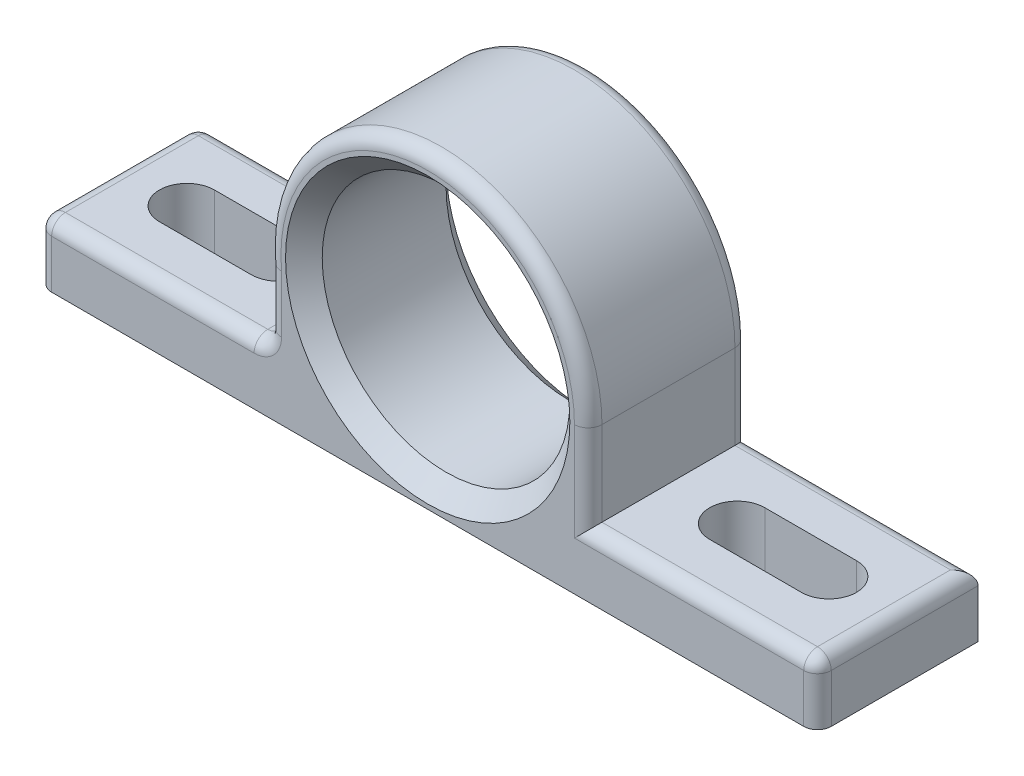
ISO-10303-21;
HEADER;
FILE_DESCRIPTION(('STEP AP214'),'2;1');
FILE_NAME('part.step','',(''),(''),'','','');
FILE_SCHEMA(('AUTOMOTIVE_DESIGN { 1 0 10303 214 1 1 1 1 }'));
ENDSEC;
DATA;
#1=APPLICATION_CONTEXT('core data for automotive mechanical design processes');
#2=APPLICATION_PROTOCOL_DEFINITION('international standard','automotive_design',2000,#1);
#3=PRODUCT_CONTEXT('',#1,'mechanical');
#4=PRODUCT('Part','Part','',(#3));
#5=PRODUCT_RELATED_PRODUCT_CATEGORY('part','',(#4));
#6=PRODUCT_DEFINITION_FORMATION('','',#4);
#7=PRODUCT_DEFINITION_CONTEXT('part definition',#1,'design');
#8=PRODUCT_DEFINITION('design','',#6,#7);
#9=PRODUCT_DEFINITION_SHAPE('','',#8);
#10=(LENGTH_UNIT() NAMED_UNIT(*) SI_UNIT(.MILLI.,.METRE.));
#11=(NAMED_UNIT(*) PLANE_ANGLE_UNIT() SI_UNIT($,.RADIAN.));
#12=(NAMED_UNIT(*) SI_UNIT($,.STERADIAN.) SOLID_ANGLE_UNIT());
#13=UNCERTAINTY_MEASURE_WITH_UNIT(LENGTH_MEASURE(1.E-05),#10,'distance_accuracy_value','');
#14=(GEOMETRIC_REPRESENTATION_CONTEXT(3) GLOBAL_UNCERTAINTY_ASSIGNED_CONTEXT((#13)) GLOBAL_UNIT_ASSIGNED_CONTEXT((#10,
#11,#12)) REPRESENTATION_CONTEXT('',''));
#15=CARTESIAN_POINT('',(0.,0.,0.));
#16=DIRECTION('',(0.,0.,1.));
#17=DIRECTION('',(1.,0.,0.));
#18=AXIS2_PLACEMENT_3D('',#15,#16,#17);
#19=CARTESIAN_POINT('',(0.,0.,17.5));
#20=DIRECTION('',(0.,0.,1.));
#21=DIRECTION('',(1.,0.,0.));
#22=AXIS2_PLACEMENT_3D('',#19,#20,#21);
#23=PLANE('',#22);
#24=CARTESIAN_POINT('',(0.,0.,17.5));
#25=DIRECTION('',(0.,0.,1.));
#26=DIRECTION('',(1.,0.,0.));
#27=AXIS2_PLACEMENT_3D('',#24,#25,#26);
#28=CIRCLE('',#27,31.);
#29=CARTESIAN_POINT('',(31.,0.,17.5));
#30=VERTEX_POINT('',#29);
#31=EDGE_CURVE('E11',#30,#30,#28,.F.);
#32=ORIENTED_EDGE('',*,*,#31,.T.);
#33=EDGE_LOOP('',(#32));
#34=FACE_BOUND('',#33,.T.);
#35=DIRECTION('',(1.,0.,0.));
#36=VECTOR('',#35,1.);
#37=CARTESIAN_POINT('',(85.,-32.,17.5));
#38=LINE('',#37,#36);
#39=CARTESIAN_POINT('',(-82.,-32.,17.5));
#40=VERTEX_POINT('',#39);
#41=CARTESIAN_POINT('',(82.,-32.,17.5));
#42=VERTEX_POINT('',#41);
#43=EDGE_CURVE('E282',#40,#42,#38,.T.);
#44=ORIENTED_EDGE('',*,*,#43,.T.);
#45=DIRECTION('',(0.,1.,0.));
#46=VECTOR('',#45,1.);
#47=CARTESIAN_POINT('',(82.,-18.4340909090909,17.5));
#48=LINE('',#47,#46);
#49=CARTESIAN_POINT('',(82.,-21.4340909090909,17.5));
#50=VERTEX_POINT('',#49);
#51=EDGE_CURVE('E360',#42,#50,#48,.T.);
#52=ORIENTED_EDGE('',*,*,#51,.T.);
#53=DIRECTION('',(-1.,0.,0.));
#54=VECTOR('',#53,1.);
#55=CARTESIAN_POINT('',(35.,-21.4340909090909,17.5));
#56=LINE('',#55,#54);
#57=CARTESIAN_POINT('',(32.,-21.4340909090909,17.5));
#58=VERTEX_POINT('',#57);
#59=EDGE_CURVE('E358',#50,#58,#56,.T.);
#60=ORIENTED_EDGE('',*,*,#59,.T.);
#61=DIRECTION('',(0.,1.,0.));
#62=VECTOR('',#61,1.);
#63=CARTESIAN_POINT('',(32.,0.,17.5));
#64=LINE('',#63,#62);
#65=CARTESIAN_POINT('',(32.,0.,17.5));
#66=VERTEX_POINT('',#65);
#67=EDGE_CURVE('E356',#58,#66,#64,.T.);
#68=ORIENTED_EDGE('',*,*,#67,.T.);
#69=CARTESIAN_POINT('',(0.,0.,17.5));
#70=DIRECTION('',(0.,0.,1.));
#71=DIRECTION('',(1.,0.,0.));
#72=AXIS2_PLACEMENT_3D('',#69,#70,#71);
#73=CIRCLE('',#72,32.);
#74=CARTESIAN_POINT('',(-31.8645447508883,-2.94122216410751,17.5));
#75=VERTEX_POINT('',#74);
#76=EDGE_CURVE('E354',#66,#75,#73,.T.);
#77=ORIENTED_EDGE('',*,*,#76,.T.);
#78=DIRECTION('',(0.,-1.,0.));
#79=VECTOR('',#78,1.);
#80=CARTESIAN_POINT('',(-31.8645447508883,-18.4340909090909,17.5));
#81=LINE('',#80,#79);
#82=CARTESIAN_POINT('',(-31.8645447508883,-15.4340909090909,17.5));
#83=VERTEX_POINT('',#82);
#84=EDGE_CURVE('E352',#75,#83,#81,.T.);
#85=ORIENTED_EDGE('',*,*,#84,.T.);
#86=CARTESIAN_POINT('',(-37.8645447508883,-15.4340909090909,17.5));
#87=DIRECTION('',(0.,0.,1.));
#88=DIRECTION('',(1.,0.,0.));
#89=AXIS2_PLACEMENT_3D('',#86,#87,#88);
#90=CIRCLE('',#89,6.);
#91=CARTESIAN_POINT('',(-37.8645447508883,-21.4340909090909,17.5));
#92=VERTEX_POINT('',#91);
#93=EDGE_CURVE('E349',#92,#83,#90,.T.);
#94=ORIENTED_EDGE('',*,*,#93,.F.);
#95=DIRECTION('',(-1.,0.,0.));
#96=VECTOR('',#95,1.);
#97=CARTESIAN_POINT('',(-85.,-21.4340909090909,17.5));
#98=LINE('',#97,#96);
#99=CARTESIAN_POINT('',(-82.,-21.4340909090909,17.5));
#100=VERTEX_POINT('',#99);
#101=EDGE_CURVE('E345',#92,#100,#98,.T.);
#102=ORIENTED_EDGE('',*,*,#101,.T.);
#103=DIRECTION('',(0.,-1.,0.));
#104=VECTOR('',#103,1.);
#105=CARTESIAN_POINT('',(-82.,-32.,17.5));
#106=LINE('',#105,#104);
#107=EDGE_CURVE('E347',#100,#40,#106,.T.);
#108=ORIENTED_EDGE('',*,*,#107,.T.);
#109=EDGE_LOOP('',(#44,#52,#60,#68,#77,#85,#94,#102,#108));
#110=FACE_BOUND('',#109,.T.);
#111=ADVANCED_FACE('F28',(#34,#110),#23,.T.);
#112=CARTESIAN_POINT('',(0.,0.,-17.5));
#113=DIRECTION('',(0.,0.,1.));
#114=DIRECTION('',(1.,0.,0.));
#115=AXIS2_PLACEMENT_3D('',#112,#113,#114);
#116=PLANE('',#115);
#117=CARTESIAN_POINT('',(0.,0.,-17.5));
#118=DIRECTION('',(0.,0.,1.));
#119=DIRECTION('',(1.,0.,0.));
#120=AXIS2_PLACEMENT_3D('',#117,#118,#119);
#121=CIRCLE('',#120,31.);
#122=CARTESIAN_POINT('',(31.,0.,-17.5));
#123=VERTEX_POINT('',#122);
#124=EDGE_CURVE('E385',#123,#123,#121,.T.);
#125=ORIENTED_EDGE('',*,*,#124,.T.);
#126=EDGE_LOOP('',(#125));
#127=FACE_BOUND('',#126,.T.);
#128=DIRECTION('',(0.,1.,0.));
#129=VECTOR('',#128,1.);
#130=CARTESIAN_POINT('',(32.,0.,-17.5));
#131=LINE('',#130,#129);
#132=CARTESIAN_POINT('',(32.,0.,-17.5));
#133=VERTEX_POINT('',#132);
#134=CARTESIAN_POINT('',(32.,-21.4340909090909,-17.5));
#135=VERTEX_POINT('',#134);
#136=EDGE_CURVE('E324',#133,#135,#131,.F.);
#137=ORIENTED_EDGE('',*,*,#136,.T.);
#138=DIRECTION('',(-1.,0.,0.));
#139=VECTOR('',#138,1.);
#140=CARTESIAN_POINT('',(0.,-21.4340909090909,-17.5));
#141=LINE('',#140,#139);
#142=CARTESIAN_POINT('',(85.,-21.4340909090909,-17.5));
#143=VERTEX_POINT('',#142);
#144=EDGE_CURVE('E327',#135,#143,#141,.F.);
#145=ORIENTED_EDGE('',*,*,#144,.T.);
#146=DIRECTION('',(0.,1.,0.));
#147=VECTOR('',#146,1.);
#148=CARTESIAN_POINT('',(85.,-18.4340909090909,-17.5));
#149=LINE('',#148,#147);
#150=CARTESIAN_POINT('',(85.,-32.,-17.5));
#151=VERTEX_POINT('',#150);
#152=EDGE_CURVE('E279',#151,#143,#149,.T.);
#153=ORIENTED_EDGE('',*,*,#152,.F.);
#154=DIRECTION('',(1.,0.,0.));
#155=VECTOR('',#154,1.);
#156=CARTESIAN_POINT('',(85.,-32.,-17.5));
#157=LINE('',#156,#155);
#158=CARTESIAN_POINT('',(-82.,-32.,-17.5));
#159=VERTEX_POINT('',#158);
#160=EDGE_CURVE('E276',#159,#151,#157,.T.);
#161=ORIENTED_EDGE('',*,*,#160,.F.);
#162=DIRECTION('',(0.,-1.,0.));
#163=VECTOR('',#162,1.);
#164=CARTESIAN_POINT('',(-82.,0.,-17.5));
#165=LINE('',#164,#163);
#166=CARTESIAN_POINT('',(-82.,-21.4340909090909,-17.5));
#167=VERTEX_POINT('',#166);
#168=EDGE_CURVE('E318',#159,#167,#165,.F.);
#169=ORIENTED_EDGE('',*,*,#168,.T.);
#170=DIRECTION('',(-1.,0.,0.));
#171=VECTOR('',#170,1.);
#172=CARTESIAN_POINT('',(0.,-21.4340909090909,-17.5));
#173=LINE('',#172,#171);
#174=CARTESIAN_POINT('',(-37.8645447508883,-21.4340909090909,-17.5));
#175=VERTEX_POINT('',#174);
#176=EDGE_CURVE('E316',#167,#175,#173,.F.);
#177=ORIENTED_EDGE('',*,*,#176,.T.);
#178=CARTESIAN_POINT('',(-37.8645447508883,-15.4340909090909,-17.5));
#179=DIRECTION('',(0.,0.,1.));
#180=DIRECTION('',(1.,0.,0.));
#181=AXIS2_PLACEMENT_3D('',#178,#179,#180);
#182=CIRCLE('',#181,6.);
#183=CARTESIAN_POINT('',(-31.8645447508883,-15.4340909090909,-17.5));
#184=VERTEX_POINT('',#183);
#185=EDGE_CURVE('E313',#184,#175,#182,.F.);
#186=ORIENTED_EDGE('',*,*,#185,.F.);
#187=DIRECTION('',(0.,-1.,0.));
#188=VECTOR('',#187,1.);
#189=CARTESIAN_POINT('',(-31.8645447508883,0.,-17.5));
#190=LINE('',#189,#188);
#191=CARTESIAN_POINT('',(-31.8645447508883,-2.94122216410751,-17.5));
#192=VERTEX_POINT('',#191);
#193=EDGE_CURVE('E320',#184,#192,#190,.F.);
#194=ORIENTED_EDGE('',*,*,#193,.T.);
#195=CARTESIAN_POINT('',(0.,0.,-17.5));
#196=DIRECTION('',(0.,0.,1.));
#197=DIRECTION('',(1.,0.,0.));
#198=AXIS2_PLACEMENT_3D('',#195,#196,#197);
#199=CIRCLE('',#198,32.);
#200=EDGE_CURVE('E322',#192,#133,#199,.F.);
#201=ORIENTED_EDGE('',*,*,#200,.T.);
#202=EDGE_LOOP('',(#137,#145,#153,#161,#169,#177,#186,#194,#201));
#203=FACE_BOUND('',#202,.T.);
#204=ADVANCED_FACE('F404',(#127,#203),#116,.F.);
#205=CARTESIAN_POINT('',(0.,0.,17.5));
#206=DIRECTION('',(0.,0.,-1.));
#207=DIRECTION('',(-1.,0.,0.));
#208=AXIS2_PLACEMENT_3D('',#205,#206,#207);
#209=CYLINDRICAL_SURFACE('',#208,35.);
#210=DIRECTION('',(0.,0.,-1.));
#211=VECTOR('',#210,1.);
#212=CARTESIAN_POINT('',(35.,0.,17.5));
#213=LINE('',#212,#211);
#214=CARTESIAN_POINT('',(35.,0.,14.5));
#215=VERTEX_POINT('',#214);
#216=CARTESIAN_POINT('',(35.,0.,-14.5));
#217=VERTEX_POINT('',#216);
#218=EDGE_CURVE('E285',#215,#217,#213,.T.);
#219=ORIENTED_EDGE('',*,*,#218,.T.);
#220=CARTESIAN_POINT('',(0.,0.,-14.5));
#221=DIRECTION('',(0.,0.,1.));
#222=DIRECTION('',(1.,0.,0.));
#223=AXIS2_PLACEMENT_3D('',#220,#221,#222);
#224=CIRCLE('',#223,35.);
#225=CARTESIAN_POINT('',(-34.8645447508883,-3.0762833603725,-14.5));
#226=VERTEX_POINT('',#225);
#227=EDGE_CURVE('E337',#217,#226,#224,.T.);
#228=ORIENTED_EDGE('',*,*,#227,.T.);
#229=DIRECTION('',(0.,0.,-1.));
#230=VECTOR('',#229,1.);
#231=CARTESIAN_POINT('',(-34.8645447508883,-3.0762833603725,17.5));
#232=LINE('',#231,#230);
#233=CARTESIAN_POINT('',(-34.8645447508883,-3.0762833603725,14.5));
#234=VERTEX_POINT('',#233);
#235=EDGE_CURVE('E296',#234,#226,#232,.T.);
#236=ORIENTED_EDGE('',*,*,#235,.F.);
#237=CARTESIAN_POINT('',(0.,0.,14.5));
#238=DIRECTION('',(0.,0.,1.));
#239=DIRECTION('',(1.,0.,0.));
#240=AXIS2_PLACEMENT_3D('',#237,#238,#239);
#241=CIRCLE('',#240,35.);
#242=EDGE_CURVE('E335',#234,#215,#241,.F.);
#243=ORIENTED_EDGE('',*,*,#242,.T.);
#244=EDGE_LOOP('',(#219,#228,#236,#243));
#245=FACE_BOUND('',#244,.T.);
#246=ADVANCED_FACE('F30',(#245),#209,.T.);
#247=CARTESIAN_POINT('',(-34.8645447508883,-3.0762833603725,17.5));
#248=DIRECTION('',(1.,0.,0.));
#249=DIRECTION('',(0.,0.,-1.));
#250=AXIS2_PLACEMENT_3D('',#247,#248,#249);
#251=PLANE('',#250);
#252=ORIENTED_EDGE('',*,*,#235,.T.);
#253=DIRECTION('',(0.,-1.,0.));
#254=VECTOR('',#253,1.);
#255=CARTESIAN_POINT('',(-34.8645447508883,-3.0762833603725,-14.5));
#256=LINE('',#255,#254);
#257=CARTESIAN_POINT('',(-34.8645447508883,-15.4340909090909,-14.5));
#258=VERTEX_POINT('',#257);
#259=EDGE_CURVE('E333',#226,#258,#256,.T.);
#260=ORIENTED_EDGE('',*,*,#259,.T.);
#261=DIRECTION('',(0.,0.,-1.));
#262=VECTOR('',#261,1.);
#263=CARTESIAN_POINT('',(-34.8645447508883,-15.4340909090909,17.5));
#264=LINE('',#263,#262);
#265=CARTESIAN_POINT('',(-34.8645447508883,-15.4340909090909,14.5));
#266=VERTEX_POINT('',#265);
#267=EDGE_CURVE('E329',#258,#266,#264,.F.);
#268=ORIENTED_EDGE('',*,*,#267,.T.);
#269=DIRECTION('',(0.,-1.,0.));
#270=VECTOR('',#269,1.);
#271=CARTESIAN_POINT('',(-34.8645447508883,-3.0762833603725,14.5));
#272=LINE('',#271,#270);
#273=EDGE_CURVE('E331',#266,#234,#272,.F.);
#274=ORIENTED_EDGE('',*,*,#273,.T.);
#275=EDGE_LOOP('',(#252,#260,#268,#274));
#276=FACE_BOUND('',#275,.T.);
#277=ADVANCED_FACE('F652',(#276),#251,.F.);
#278=CARTESIAN_POINT('',(-85.,-18.4340909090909,17.5));
#279=DIRECTION('',(0.,-1.,0.));
#280=DIRECTION('',(0.,0.,-1.));
#281=AXIS2_PLACEMENT_3D('',#278,#279,#280);
#282=PLANE('',#281);
#283=DIRECTION('',(-1.,0.,0.));
#284=VECTOR('',#283,1.);
#285=CARTESIAN_POINT('',(-34.8645447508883,-18.4340909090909,14.5));
#286=LINE('',#285,#284);
#287=CARTESIAN_POINT('',(-82.,-18.4340909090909,14.5));
#288=VERTEX_POINT('',#287);
#289=CARTESIAN_POINT('',(-37.8645447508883,-18.4340909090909,14.5));
#290=VERTEX_POINT('',#289);
#291=EDGE_CURVE('E372',#288,#290,#286,.F.);
#292=ORIENTED_EDGE('',*,*,#291,.T.);
#293=DIRECTION('',(0.,0.,-1.));
#294=VECTOR('',#293,1.);
#295=CARTESIAN_POINT('',(-37.8645447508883,-18.4340909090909,-17.5));
#296=LINE('',#295,#294);
#297=CARTESIAN_POINT('',(-37.8645447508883,-18.4340909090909,-14.5));
#298=VERTEX_POINT('',#297);
#299=EDGE_CURVE('E378',#290,#298,#296,.T.);
#300=ORIENTED_EDGE('',*,*,#299,.T.);
#301=DIRECTION('',(-1.,0.,0.));
#302=VECTOR('',#301,1.);
#303=CARTESIAN_POINT('',(-85.,-18.4340909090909,-14.5));
#304=LINE('',#303,#302);
#305=CARTESIAN_POINT('',(-82.,-18.4340909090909,-14.5));
#306=VERTEX_POINT('',#305);
#307=EDGE_CURVE('E376',#298,#306,#304,.T.);
#308=ORIENTED_EDGE('',*,*,#307,.T.);
#309=DIRECTION('',(0.,0.,-1.));
#310=VECTOR('',#309,1.);
#311=CARTESIAN_POINT('',(-82.,-18.4340909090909,17.5));
#312=LINE('',#311,#310);
#313=EDGE_CURVE('E374',#306,#288,#312,.F.);
#314=ORIENTED_EDGE('',*,*,#313,.T.);
#315=EDGE_LOOP('',(#292,#300,#308,#314));
#316=FACE_BOUND('',#315,.T.);
#317=CARTESIAN_POINT('',(-50.,-18.4340909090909,0.));
#318=DIRECTION('',(0.,-1.,0.));
#319=DIRECTION('',(0.,0.,-1.));
#320=AXIS2_PLACEMENT_3D('',#317,#318,#319);
#321=CIRCLE('',#320,6.);
#322=CARTESIAN_POINT('',(-50.,-18.4340909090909,-6.));
#323=VERTEX_POINT('',#322);
#324=CARTESIAN_POINT('',(-50.,-18.4340909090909,6.));
#325=VERTEX_POINT('',#324);
#326=EDGE_CURVE('E267',#323,#325,#321,.T.);
#327=ORIENTED_EDGE('',*,*,#326,.T.);
#328=DIRECTION('',(-1.,0.,0.));
#329=VECTOR('',#328,1.);
#330=CARTESIAN_POINT('',(-85.,-18.4340909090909,6.));
#331=LINE('',#330,#329);
#332=CARTESIAN_POINT('',(-70.,-18.4340909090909,6.));
#333=VERTEX_POINT('',#332);
#334=EDGE_CURVE('E273',#325,#333,#331,.T.);
#335=ORIENTED_EDGE('',*,*,#334,.T.);
#336=CARTESIAN_POINT('',(-70.,-18.4340909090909,0.));
#337=DIRECTION('',(0.,-1.,0.));
#338=DIRECTION('',(0.,0.,-1.));
#339=AXIS2_PLACEMENT_3D('',#336,#337,#338);
#340=CIRCLE('',#339,6.);
#341=CARTESIAN_POINT('',(-70.,-18.4340909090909,-6.));
#342=VERTEX_POINT('',#341);
#343=EDGE_CURVE('E270',#333,#342,#340,.T.);
#344=ORIENTED_EDGE('',*,*,#343,.T.);
#345=DIRECTION('',(1.,0.,0.));
#346=VECTOR('',#345,1.);
#347=CARTESIAN_POINT('',(-85.,-18.4340909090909,-6.));
#348=LINE('',#347,#346);
#349=EDGE_CURVE('E258',#342,#323,#348,.T.);
#350=ORIENTED_EDGE('',*,*,#349,.T.);
#351=EDGE_LOOP('',(#327,#335,#344,#350));
#352=FACE_BOUND('',#351,.T.);
#353=ADVANCED_FACE('F605',(#316,#352),#282,.F.);
#354=CARTESIAN_POINT('',(-85.,-32.,17.5));
#355=DIRECTION('',(1.,0.,0.));
#356=DIRECTION('',(0.,1.,0.));
#357=AXIS2_PLACEMENT_3D('',#354,#355,#356);
#358=PLANE('',#357);
#359=DIRECTION('',(0.,0.,-1.));
#360=VECTOR('',#359,1.);
#361=CARTESIAN_POINT('',(-85.,-21.4340909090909,17.5));
#362=LINE('',#361,#360);
#363=CARTESIAN_POINT('',(-85.,-21.4340909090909,14.5));
#364=VERTEX_POINT('',#363);
#365=CARTESIAN_POINT('',(-85.,-21.4340909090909,-14.5));
#366=VERTEX_POINT('',#365);
#367=EDGE_CURVE('E43',#364,#366,#362,.T.);
#368=ORIENTED_EDGE('',*,*,#367,.T.);
#369=DIRECTION('',(0.,-1.,0.));
#370=VECTOR('',#369,1.);
#371=CARTESIAN_POINT('',(-85.,-32.,-14.5));
#372=LINE('',#371,#370);
#373=CARTESIAN_POINT('',(-85.,-32.,-14.5));
#374=VERTEX_POINT('',#373);
#375=EDGE_CURVE('E383',#366,#374,#372,.T.);
#376=ORIENTED_EDGE('',*,*,#375,.T.);
#377=DIRECTION('',(0.,0.,-1.));
#378=VECTOR('',#377,1.);
#379=CARTESIAN_POINT('',(-85.,-32.,17.5));
#380=LINE('',#379,#378);
#381=CARTESIAN_POINT('',(-85.,-32.,14.5));
#382=VERTEX_POINT('',#381);
#383=EDGE_CURVE('E293',#382,#374,#380,.T.);
#384=ORIENTED_EDGE('',*,*,#383,.F.);
#385=DIRECTION('',(0.,-1.,0.));
#386=VECTOR('',#385,1.);
#387=CARTESIAN_POINT('',(-85.,-18.4340909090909,14.5));
#388=LINE('',#387,#386);
#389=EDGE_CURVE('E48',#382,#364,#388,.F.);
#390=ORIENTED_EDGE('',*,*,#389,.T.);
#391=EDGE_LOOP('',(#368,#376,#384,#390));
#392=FACE_BOUND('',#391,.T.);
#393=ADVANCED_FACE('F615',(#392),#358,.F.);
#394=CARTESIAN_POINT('',(85.,-32.,17.5));
#395=DIRECTION('',(0.,1.,0.));
#396=DIRECTION('',(-1.,0.,0.));
#397=AXIS2_PLACEMENT_3D('',#394,#395,#396);
#398=PLANE('',#397);
#399=CARTESIAN_POINT('',(50.,-32.,0.));
#400=DIRECTION('',(0.,-1.,0.));
#401=DIRECTION('',(1.,0.,0.));
#402=AXIS2_PLACEMENT_3D('',#399,#400,#401);
#403=CIRCLE('',#402,6.);
#404=CARTESIAN_POINT('',(50.,-32.,6.));
#405=VERTEX_POINT('',#404);
#406=CARTESIAN_POINT('',(50.,-32.,-6.));
#407=VERTEX_POINT('',#406);
#408=EDGE_CURVE('E221',#405,#407,#403,.T.);
#409=ORIENTED_EDGE('',*,*,#408,.F.);
#410=DIRECTION('',(-1.,0.,0.));
#411=VECTOR('',#410,1.);
#412=CARTESIAN_POINT('',(50.,-32.,6.));
#413=LINE('',#412,#411);
#414=CARTESIAN_POINT('',(70.,-32.,6.));
#415=VERTEX_POINT('',#414);
#416=EDGE_CURVE('E218',#415,#405,#413,.T.);
#417=ORIENTED_EDGE('',*,*,#416,.F.);
#418=CARTESIAN_POINT('',(70.,-32.,0.));
#419=DIRECTION('',(0.,-1.,0.));
#420=DIRECTION('',(1.,0.,0.));
#421=AXIS2_PLACEMENT_3D('',#418,#419,#420);
#422=CIRCLE('',#421,6.);
#423=CARTESIAN_POINT('',(70.,-32.,-6.));
#424=VERTEX_POINT('',#423);
#425=EDGE_CURVE('E234',#424,#415,#422,.T.);
#426=ORIENTED_EDGE('',*,*,#425,.F.);
#427=DIRECTION('',(1.,0.,0.));
#428=VECTOR('',#427,1.);
#429=CARTESIAN_POINT('',(50.,-32.,-6.));
#430=LINE('',#429,#428);
#431=EDGE_CURVE('E211',#407,#424,#430,.T.);
#432=ORIENTED_EDGE('',*,*,#431,.F.);
#433=EDGE_LOOP('',(#409,#417,#426,#432));
#434=FACE_BOUND('',#433,.T.);
#435=CARTESIAN_POINT('',(-70.,-32.,0.));
#436=DIRECTION('',(0.,-1.,0.));
#437=DIRECTION('',(1.,0.,0.));
#438=AXIS2_PLACEMENT_3D('',#435,#436,#437);
#439=CIRCLE('',#438,6.);
#440=CARTESIAN_POINT('',(-70.,-32.,6.));
#441=VERTEX_POINT('',#440);
#442=CARTESIAN_POINT('',(-70.,-32.,-6.));
#443=VERTEX_POINT('',#442);
#444=EDGE_CURVE('E241',#441,#443,#439,.T.);
#445=ORIENTED_EDGE('',*,*,#444,.F.);
#446=DIRECTION('',(-1.,0.,0.));
#447=VECTOR('',#446,1.);
#448=CARTESIAN_POINT('',(-70.,-32.,6.));
#449=LINE('',#448,#447);
#450=CARTESIAN_POINT('',(-50.,-32.,6.));
#451=VERTEX_POINT('',#450);
#452=EDGE_CURVE('E252',#451,#441,#449,.T.);
#453=ORIENTED_EDGE('',*,*,#452,.F.);
#454=CARTESIAN_POINT('',(-50.,-32.,0.));
#455=DIRECTION('',(0.,-1.,0.));
#456=DIRECTION('',(1.,0.,0.));
#457=AXIS2_PLACEMENT_3D('',#454,#455,#456);
#458=CIRCLE('',#457,6.);
#459=CARTESIAN_POINT('',(-50.,-32.,-6.));
#460=VERTEX_POINT('',#459);
#461=EDGE_CURVE('E249',#460,#451,#458,.T.);
#462=ORIENTED_EDGE('',*,*,#461,.F.);
#463=DIRECTION('',(1.,0.,0.));
#464=VECTOR('',#463,1.);
#465=CARTESIAN_POINT('',(-70.,-32.,-6.));
#466=LINE('',#465,#464);
#467=EDGE_CURVE('E246',#443,#460,#466,.T.);
#468=ORIENTED_EDGE('',*,*,#467,.F.);
#469=EDGE_LOOP('',(#445,#453,#462,#468));
#470=FACE_BOUND('',#469,.T.);
#471=DIRECTION('',(0.,0.,-1.));
#472=VECTOR('',#471,1.);
#473=CARTESIAN_POINT('',(85.,-32.,17.5));
#474=LINE('',#473,#472);
#475=CARTESIAN_POINT('',(85.,-32.,14.5));
#476=VERTEX_POINT('',#475);
#477=EDGE_CURVE('E291',#476,#151,#474,.T.);
#478=ORIENTED_EDGE('',*,*,#477,.F.);
#479=CARTESIAN_POINT('',(82.,-32.,14.5));
#480=DIRECTION('',(0.,1.,0.));
#481=DIRECTION('',(-1.,0.,0.));
#482=AXIS2_PLACEMENT_3D('',#479,#480,#481);
#483=CIRCLE('',#482,3.);
#484=EDGE_CURVE('E370',#476,#42,#483,.F.);
#485=ORIENTED_EDGE('',*,*,#484,.T.);
#486=ORIENTED_EDGE('',*,*,#43,.F.);
#487=CARTESIAN_POINT('',(-82.,-32.,14.5));
#488=DIRECTION('',(0.,1.,0.));
#489=DIRECTION('',(-1.,0.,0.));
#490=AXIS2_PLACEMENT_3D('',#487,#488,#489);
#491=CIRCLE('',#490,3.);
#492=EDGE_CURVE('E366',#40,#382,#491,.F.);
#493=ORIENTED_EDGE('',*,*,#492,.T.);
#494=ORIENTED_EDGE('',*,*,#383,.T.);
#495=CARTESIAN_POINT('',(-82.,-32.,-14.5));
#496=DIRECTION('',(0.,1.,0.));
#497=DIRECTION('',(-1.,0.,0.));
#498=AXIS2_PLACEMENT_3D('',#495,#496,#497);
#499=CIRCLE('',#498,3.);
#500=EDGE_CURVE('E368',#374,#159,#499,.F.);
#501=ORIENTED_EDGE('',*,*,#500,.T.);
#502=ORIENTED_EDGE('',*,*,#160,.T.);
#503=EDGE_LOOP('',(#478,#485,#486,#493,#494,#501,#502));
#504=FACE_BOUND('',#503,.T.);
#505=ADVANCED_FACE('F231',(#434,#470,#504),#398,.F.);
#506=CARTESIAN_POINT('',(85.,-18.4340909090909,17.5));
#507=DIRECTION('',(-1.,0.,0.));
#508=DIRECTION('',(0.,0.,1.));
#509=AXIS2_PLACEMENT_3D('',#506,#507,#508);
#510=PLANE('',#509);
#511=DIRECTION('',(0.,0.,-1.));
#512=VECTOR('',#511,1.);
#513=CARTESIAN_POINT('',(85.,-21.4340909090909,17.5));
#514=LINE('',#513,#512);
#515=CARTESIAN_POINT('',(85.,-21.4340909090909,14.5));
#516=VERTEX_POINT('',#515);
#517=EDGE_CURVE('E362',#143,#516,#514,.F.);
#518=ORIENTED_EDGE('',*,*,#517,.T.);
#519=DIRECTION('',(0.,1.,0.));
#520=VECTOR('',#519,1.);
#521=CARTESIAN_POINT('',(85.,-32.,14.5));
#522=LINE('',#521,#520);
#523=EDGE_CURVE('E364',#516,#476,#522,.F.);
#524=ORIENTED_EDGE('',*,*,#523,.T.);
#525=ORIENTED_EDGE('',*,*,#477,.T.);
#526=ORIENTED_EDGE('',*,*,#152,.T.);
#527=EDGE_LOOP('',(#518,#524,#525,#526));
#528=FACE_BOUND('',#527,.T.);
#529=ADVANCED_FACE('F579',(#528),#510,.F.);
#530=CARTESIAN_POINT('',(35.,-18.4340909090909,17.5));
#531=DIRECTION('',(0.,-1.,0.));
#532=DIRECTION('',(0.,0.,-1.));
#533=AXIS2_PLACEMENT_3D('',#530,#531,#532);
#534=PLANE('',#533);
#535=DIRECTION('',(-1.,0.,0.));
#536=VECTOR('',#535,1.);
#537=CARTESIAN_POINT('',(35.,-18.4340909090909,6.));
#538=LINE('',#537,#536);
#539=CARTESIAN_POINT('',(70.,-18.4340909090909,6.));
#540=VERTEX_POINT('',#539);
#541=CARTESIAN_POINT('',(50.,-18.4340909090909,6.));
#542=VERTEX_POINT('',#541);
#543=EDGE_CURVE('E303',#540,#542,#538,.T.);
#544=ORIENTED_EDGE('',*,*,#543,.T.);
#545=CARTESIAN_POINT('',(50.,-18.4340909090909,0.));
#546=DIRECTION('',(0.,-1.,0.));
#547=DIRECTION('',(0.,0.,-1.));
#548=AXIS2_PLACEMENT_3D('',#545,#546,#547);
#549=CIRCLE('',#548,6.);
#550=CARTESIAN_POINT('',(50.,-18.4340909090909,-6.));
#551=VERTEX_POINT('',#550);
#552=EDGE_CURVE('E306',#542,#551,#549,.T.);
#553=ORIENTED_EDGE('',*,*,#552,.T.);
#554=DIRECTION('',(1.,0.,0.));
#555=VECTOR('',#554,1.);
#556=CARTESIAN_POINT('',(35.,-18.4340909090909,-6.));
#557=LINE('',#556,#555);
#558=CARTESIAN_POINT('',(70.,-18.4340909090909,-6.));
#559=VERTEX_POINT('',#558);
#560=EDGE_CURVE('E214',#551,#559,#557,.T.);
#561=ORIENTED_EDGE('',*,*,#560,.T.);
#562=CARTESIAN_POINT('',(70.,-18.4340909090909,0.));
#563=DIRECTION('',(0.,-1.,0.));
#564=DIRECTION('',(0.,0.,-1.));
#565=AXIS2_PLACEMENT_3D('',#562,#563,#564);
#566=CIRCLE('',#565,6.);
#567=EDGE_CURVE('E299',#559,#540,#566,.T.);
#568=ORIENTED_EDGE('',*,*,#567,.T.);
#569=EDGE_LOOP('',(#544,#553,#561,#568));
#570=FACE_BOUND('',#569,.T.);
#571=DIRECTION('',(0.,0.,-1.));
#572=VECTOR('',#571,1.);
#573=CARTESIAN_POINT('',(82.,-18.4340909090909,17.5));
#574=LINE('',#573,#572);
#575=CARTESIAN_POINT('',(82.,-18.4340909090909,14.5));
#576=VERTEX_POINT('',#575);
#577=CARTESIAN_POINT('',(82.,-18.4340909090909,-14.5));
#578=VERTEX_POINT('',#577);
#579=EDGE_CURVE('E341',#576,#578,#574,.T.);
#580=ORIENTED_EDGE('',*,*,#579,.T.);
#581=DIRECTION('',(-1.,0.,0.));
#582=VECTOR('',#581,1.);
#583=CARTESIAN_POINT('',(35.,-18.4340909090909,-14.5));
#584=LINE('',#583,#582);
#585=CARTESIAN_POINT('',(35.,-18.4340909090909,-14.5));
#586=VERTEX_POINT('',#585);
#587=EDGE_CURVE('E343',#578,#586,#584,.T.);
#588=ORIENTED_EDGE('',*,*,#587,.T.);
#589=DIRECTION('',(0.,0.,-1.));
#590=VECTOR('',#589,1.);
#591=CARTESIAN_POINT('',(35.,-18.4340909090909,17.5));
#592=LINE('',#591,#590);
#593=CARTESIAN_POINT('',(35.,-18.4340909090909,14.5));
#594=VERTEX_POINT('',#593);
#595=EDGE_CURVE('E288',#594,#586,#592,.T.);
#596=ORIENTED_EDGE('',*,*,#595,.F.);
#597=DIRECTION('',(-1.,0.,0.));
#598=VECTOR('',#597,1.);
#599=CARTESIAN_POINT('',(85.,-18.4340909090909,14.5));
#600=LINE('',#599,#598);
#601=EDGE_CURVE('E339',#594,#576,#600,.F.);
#602=ORIENTED_EDGE('',*,*,#601,.T.);
#603=EDGE_LOOP('',(#580,#588,#596,#602));
#604=FACE_BOUND('',#603,.T.);
#605=ADVANCED_FACE('F640',(#570,#604),#534,.F.);
#606=CARTESIAN_POINT('',(35.,0.,17.5));
#607=DIRECTION('',(-1.,0.,0.));
#608=DIRECTION('',(0.,0.,1.));
#609=AXIS2_PLACEMENT_3D('',#606,#607,#608);
#610=PLANE('',#609);
#611=ORIENTED_EDGE('',*,*,#595,.T.);
#612=DIRECTION('',(0.,1.,0.));
#613=VECTOR('',#612,1.);
#614=CARTESIAN_POINT('',(35.,0.,-14.5));
#615=LINE('',#614,#613);
#616=EDGE_CURVE('E310',#586,#217,#615,.T.);
#617=ORIENTED_EDGE('',*,*,#616,.T.);
#618=ORIENTED_EDGE('',*,*,#218,.F.);
#619=DIRECTION('',(0.,1.,0.));
#620=VECTOR('',#619,1.);
#621=CARTESIAN_POINT('',(35.,-18.4340909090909,14.5));
#622=LINE('',#621,#620);
#623=EDGE_CURVE('E308',#215,#594,#622,.F.);
#624=ORIENTED_EDGE('',*,*,#623,.T.);
#625=EDGE_LOOP('',(#611,#617,#618,#624));
#626=FACE_BOUND('',#625,.T.);
#627=ADVANCED_FACE('F637',(#626),#610,.F.);
#628=CARTESIAN_POINT('',(0.,0.,17.5));
#629=DIRECTION('',(0.,0.,-1.));
#630=DIRECTION('',(-1.,0.,0.));
#631=AXIS2_PLACEMENT_3D('',#628,#629,#630);
#632=CYLINDRICAL_SURFACE('',#631,27.);
#633=CARTESIAN_POINT('',(0.,0.,-13.5));
#634=DIRECTION('',(0.,0.,1.));
#635=DIRECTION('',(1.,0.,0.));
#636=AXIS2_PLACEMENT_3D('',#633,#634,#635);
#637=CIRCLE('',#636,27.);
#638=CARTESIAN_POINT('',(27.,0.,-13.5));
#639=VERTEX_POINT('',#638);
#640=EDGE_CURVE('E36',#639,#639,#637,.F.);
#641=ORIENTED_EDGE('',*,*,#640,.T.);
#642=EDGE_LOOP('',(#641));
#643=FACE_BOUND('',#642,.T.);
#644=CARTESIAN_POINT('',(0.,0.,13.5));
#645=DIRECTION('',(0.,0.,1.));
#646=DIRECTION('',(1.,0.,0.));
#647=AXIS2_PLACEMENT_3D('',#644,#645,#646);
#648=CIRCLE('',#647,27.);
#649=CARTESIAN_POINT('',(27.,0.,13.5));
#650=VERTEX_POINT('',#649);
#651=EDGE_CURVE('E388',#650,#650,#648,.T.);
#652=ORIENTED_EDGE('',*,*,#651,.T.);
#653=EDGE_LOOP('',(#652));
#654=FACE_BOUND('',#653,.T.);
#655=ADVANCED_FACE('F393',(#643,#654),#632,.F.);
#656=CARTESIAN_POINT('',(-70.,7.99999999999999,6.));
#657=DIRECTION('',(0.,0.,1.));
#658=DIRECTION('',(1.,0.,0.));
#659=AXIS2_PLACEMENT_3D('',#656,#657,#658);
#660=PLANE('',#659);
#661=DIRECTION('',(0.,-1.,0.));
#662=VECTOR('',#661,1.);
#663=CARTESIAN_POINT('',(-50.,7.99999999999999,6.));
#664=LINE('',#663,#662);
#665=EDGE_CURVE('E259',#325,#451,#664,.T.);
#666=ORIENTED_EDGE('',*,*,#665,.T.);
#667=ORIENTED_EDGE('',*,*,#452,.T.);
#668=DIRECTION('',(0.,-1.,0.));
#669=VECTOR('',#668,1.);
#670=CARTESIAN_POINT('',(-70.,7.99999999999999,6.));
#671=LINE('',#670,#669);
#672=EDGE_CURVE('E256',#333,#441,#671,.T.);
#673=ORIENTED_EDGE('',*,*,#672,.F.);
#674=ORIENTED_EDGE('',*,*,#334,.F.);
#675=EDGE_LOOP('',(#666,#667,#673,#674));
#676=FACE_BOUND('',#675,.T.);
#677=ADVANCED_FACE('F684',(#676),#660,.F.);
#678=CARTESIAN_POINT('',(-70.,7.99999999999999,0.));
#679=DIRECTION('',(0.,-1.,0.));
#680=DIRECTION('',(1.,0.,0.));
#681=AXIS2_PLACEMENT_3D('',#678,#679,#680);
#682=CYLINDRICAL_SURFACE('',#681,6.);
#683=ORIENTED_EDGE('',*,*,#672,.T.);
#684=ORIENTED_EDGE('',*,*,#444,.T.);
#685=DIRECTION('',(0.,-1.,0.));
#686=VECTOR('',#685,1.);
#687=CARTESIAN_POINT('',(-70.,7.99999999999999,-6.));
#688=LINE('',#687,#686);
#689=EDGE_CURVE('E255',#342,#443,#688,.T.);
#690=ORIENTED_EDGE('',*,*,#689,.F.);
#691=ORIENTED_EDGE('',*,*,#343,.F.);
#692=EDGE_LOOP('',(#683,#684,#690,#691));
#693=FACE_BOUND('',#692,.T.);
#694=ADVANCED_FACE('F877',(#693),#682,.F.);
#695=CARTESIAN_POINT('',(-50.,7.99999999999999,0.));
#696=DIRECTION('',(0.,-1.,0.));
#697=DIRECTION('',(1.,0.,0.));
#698=AXIS2_PLACEMENT_3D('',#695,#696,#697);
#699=CYLINDRICAL_SURFACE('',#698,6.);
#700=DIRECTION('',(0.,-1.,0.));
#701=VECTOR('',#700,1.);
#702=CARTESIAN_POINT('',(-50.,7.99999999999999,-6.));
#703=LINE('',#702,#701);
#704=EDGE_CURVE('E261',#323,#460,#703,.T.);
#705=ORIENTED_EDGE('',*,*,#704,.T.);
#706=ORIENTED_EDGE('',*,*,#461,.T.);
#707=ORIENTED_EDGE('',*,*,#665,.F.);
#708=ORIENTED_EDGE('',*,*,#326,.F.);
#709=EDGE_LOOP('',(#705,#706,#707,#708));
#710=FACE_BOUND('',#709,.T.);
#711=ADVANCED_FACE('F868',(#710),#699,.F.);
#712=CARTESIAN_POINT('',(-70.,7.99999999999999,-6.));
#713=DIRECTION('',(0.,0.,-1.));
#714=DIRECTION('',(-1.,0.,0.));
#715=AXIS2_PLACEMENT_3D('',#712,#713,#714);
#716=PLANE('',#715);
#717=ORIENTED_EDGE('',*,*,#689,.T.);
#718=ORIENTED_EDGE('',*,*,#467,.T.);
#719=ORIENTED_EDGE('',*,*,#704,.F.);
#720=ORIENTED_EDGE('',*,*,#349,.F.);
#721=EDGE_LOOP('',(#717,#718,#719,#720));
#722=FACE_BOUND('',#721,.T.);
#723=ADVANCED_FACE('F860',(#722),#716,.F.);
#724=CARTESIAN_POINT('',(50.,8.00000000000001,0.));
#725=DIRECTION('',(0.,-1.,0.));
#726=DIRECTION('',(1.,0.,0.));
#727=AXIS2_PLACEMENT_3D('',#724,#725,#726);
#728=CYLINDRICAL_SURFACE('',#727,6.);
#729=DIRECTION('',(0.,-1.,0.));
#730=VECTOR('',#729,1.);
#731=CARTESIAN_POINT('',(50.,8.00000000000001,6.));
#732=LINE('',#731,#730);
#733=EDGE_CURVE('E224',#542,#405,#732,.T.);
#734=ORIENTED_EDGE('',*,*,#733,.T.);
#735=ORIENTED_EDGE('',*,*,#408,.T.);
#736=DIRECTION('',(0.,-1.,0.));
#737=VECTOR('',#736,1.);
#738=CARTESIAN_POINT('',(50.,8.00000000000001,-6.));
#739=LINE('',#738,#737);
#740=EDGE_CURVE('E206',#551,#407,#739,.T.);
#741=ORIENTED_EDGE('',*,*,#740,.F.);
#742=ORIENTED_EDGE('',*,*,#552,.F.);
#743=EDGE_LOOP('',(#734,#735,#741,#742));
#744=FACE_BOUND('',#743,.T.);
#745=ADVANCED_FACE('F222',(#744),#728,.F.);
#746=CARTESIAN_POINT('',(50.,8.00000000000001,6.));
#747=DIRECTION('',(0.,0.,1.));
#748=DIRECTION('',(1.,0.,0.));
#749=AXIS2_PLACEMENT_3D('',#746,#747,#748);
#750=PLANE('',#749);
#751=DIRECTION('',(0.,-1.,0.));
#752=VECTOR('',#751,1.);
#753=CARTESIAN_POINT('',(70.,8.00000000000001,6.));
#754=LINE('',#753,#752);
#755=EDGE_CURVE('E242',#540,#415,#754,.T.);
#756=ORIENTED_EDGE('',*,*,#755,.T.);
#757=ORIENTED_EDGE('',*,*,#416,.T.);
#758=ORIENTED_EDGE('',*,*,#733,.F.);
#759=ORIENTED_EDGE('',*,*,#543,.F.);
#760=EDGE_LOOP('',(#756,#757,#758,#759));
#761=FACE_BOUND('',#760,.T.);
#762=ADVANCED_FACE('F845',(#761),#750,.F.);
#763=CARTESIAN_POINT('',(50.,8.00000000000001,-6.));
#764=DIRECTION('',(0.,0.,-1.));
#765=DIRECTION('',(-1.,0.,0.));
#766=AXIS2_PLACEMENT_3D('',#763,#764,#765);
#767=PLANE('',#766);
#768=ORIENTED_EDGE('',*,*,#740,.T.);
#769=ORIENTED_EDGE('',*,*,#431,.T.);
#770=DIRECTION('',(0.,-1.,0.));
#771=VECTOR('',#770,1.);
#772=CARTESIAN_POINT('',(70.,8.00000000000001,-6.));
#773=LINE('',#772,#771);
#774=EDGE_CURVE('E217',#559,#424,#773,.T.);
#775=ORIENTED_EDGE('',*,*,#774,.F.);
#776=ORIENTED_EDGE('',*,*,#560,.F.);
#777=EDGE_LOOP('',(#768,#769,#775,#776));
#778=FACE_BOUND('',#777,.T.);
#779=ADVANCED_FACE('F208',(#778),#767,.F.);
#780=CARTESIAN_POINT('',(70.,8.00000000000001,0.));
#781=DIRECTION('',(0.,-1.,0.));
#782=DIRECTION('',(1.,0.,0.));
#783=AXIS2_PLACEMENT_3D('',#780,#781,#782);
#784=CYLINDRICAL_SURFACE('',#783,6.);
#785=ORIENTED_EDGE('',*,*,#774,.T.);
#786=ORIENTED_EDGE('',*,*,#425,.T.);
#787=ORIENTED_EDGE('',*,*,#755,.F.);
#788=ORIENTED_EDGE('',*,*,#567,.F.);
#789=EDGE_LOOP('',(#785,#786,#787,#788));
#790=FACE_BOUND('',#789,.T.);
#791=ADVANCED_FACE('F621',(#790),#784,.F.);
#792=CARTESIAN_POINT('',(-82.,0.,14.5));
#793=DIRECTION('',(0.,1.,0.));
#794=DIRECTION('',(-1.,0.,0.));
#795=AXIS2_PLACEMENT_3D('',#792,#793,#794);
#796=CYLINDRICAL_SURFACE('',#795,3.);
#797=CARTESIAN_POINT('',(-82.,-21.4340909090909,14.5));
#798=DIRECTION('',(0.,1.,0.));
#799=DIRECTION('',(-1.,0.,0.));
#800=AXIS2_PLACEMENT_3D('',#797,#798,#799);
#801=CIRCLE('',#800,3.);
#802=EDGE_CURVE('E228',#364,#100,#801,.T.);
#803=ORIENTED_EDGE('',*,*,#802,.F.);
#804=ORIENTED_EDGE('',*,*,#389,.F.);
#805=ORIENTED_EDGE('',*,*,#492,.F.);
#806=ORIENTED_EDGE('',*,*,#107,.F.);
#807=EDGE_LOOP('',(#803,#804,#805,#806));
#808=FACE_BOUND('',#807,.T.);
#809=ADVANCED_FACE('F619',(#808),#796,.T.);
#810=CARTESIAN_POINT('',(-82.,-21.4340909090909,14.5));
#811=DIRECTION('',(0.,0.,1.));
#812=DIRECTION('',(1.,0.,0.));
#813=AXIS2_PLACEMENT_3D('',#810,#811,#812);
#814=SPHERICAL_SURFACE('',#813,3.);
#815=CARTESIAN_POINT('',(-82.,-21.4340909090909,14.5));
#816=DIRECTION('',(0.,0.,1.));
#817=DIRECTION('',(1.,0.,0.));
#818=AXIS2_PLACEMENT_3D('',#815,#816,#817);
#819=CIRCLE('',#818,3.);
#820=EDGE_CURVE('E522',#364,#288,#819,.F.);
#821=ORIENTED_EDGE('',*,*,#820,.F.);
#822=ORIENTED_EDGE('',*,*,#802,.T.);
#823=CARTESIAN_POINT('',(-82.,-21.4340909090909,14.5));
#824=DIRECTION('',(-1.,0.,0.));
#825=DIRECTION('',(0.,0.,1.));
#826=AXIS2_PLACEMENT_3D('',#823,#824,#825);
#827=CIRCLE('',#826,3.);
#828=EDGE_CURVE('E512',#288,#100,#827,.F.);
#829=ORIENTED_EDGE('',*,*,#828,.F.);
#830=EDGE_LOOP('',(#821,#822,#829));
#831=FACE_BOUND('',#830,.T.);
#832=ADVANCED_FACE('F519',(#831),#814,.T.);
#833=CARTESIAN_POINT('',(0.,0.,14.5));
#834=DIRECTION('',(0.,0.,1.));
#835=DIRECTION('',(1.,0.,0.));
#836=AXIS2_PLACEMENT_3D('',#833,#834,#835);
#837=TOROIDAL_SURFACE('',#836,32.,3.);
#838=CARTESIAN_POINT('',(32.,0.,14.5));
#839=DIRECTION('',(0.,-1.,0.));
#840=DIRECTION('',(0.,0.,-1.));
#841=AXIS2_PLACEMENT_3D('',#838,#839,#840);
#842=CIRCLE('',#841,3.);
#843=EDGE_CURVE('E528',#215,#66,#842,.T.);
#844=ORIENTED_EDGE('',*,*,#843,.F.);
#845=ORIENTED_EDGE('',*,*,#242,.F.);
#846=CARTESIAN_POINT('',(-34.8645447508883,-3.0762833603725,14.5));
#847=CARTESIAN_POINT('',(-34.8645528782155,-3.07628366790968,14.5843169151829));
#848=CARTESIAN_POINT('',(-34.8609901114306,-3.07612684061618,14.6686299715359));
#849=CARTESIAN_POINT('',(-34.8467856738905,-3.07550132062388,14.8366524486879));
#850=CARTESIAN_POINT('',(-34.8361443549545,-3.0750326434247,14.9203618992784));
#851=CARTESIAN_POINT('',(-34.807855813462,-3.07378627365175,15.0865302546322));
#852=CARTESIAN_POINT('',(-34.7902136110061,-3.0730088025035,15.1689900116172));
#853=CARTESIAN_POINT('',(-34.7480671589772,-3.0711504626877,15.3321085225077));
#854=CARTESIAN_POINT('',(-34.7235629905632,-3.0700695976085,15.4127672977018));
#855=CARTESIAN_POINT('',(-34.6399576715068,-3.06637937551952,15.6512618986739));
#856=CARTESIAN_POINT('',(-34.5707517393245,-3.06332186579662,15.8056859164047));
#857=CARTESIAN_POINT('',(-34.407482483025,-3.05609380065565,16.1005968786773));
#858=CARTESIAN_POINT('',(-34.3134247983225,-3.05192349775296,16.2410869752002));
#859=CARTESIAN_POINT('',(-34.1030566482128,-3.04257226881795,16.5043578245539));
#860=CARTESIAN_POINT('',(-33.9867379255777,-3.03739096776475,16.6271319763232));
#861=CARTESIAN_POINT('',(-33.7351373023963,-3.02614978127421,16.8514461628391));
#862=CARTESIAN_POINT('',(-33.5998492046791,-3.020089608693,16.9529792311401));
#863=CARTESIAN_POINT('',(-33.3140337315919,-3.00724307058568,17.1320075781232));
#864=CARTESIAN_POINT('',(-33.1634885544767,-3.00045585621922,17.2094743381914));
#865=CARTESIAN_POINT('',(-32.8516068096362,-2.98634272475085,17.3379734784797));
#866=CARTESIAN_POINT('',(-32.6902793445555,-2.97901726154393,17.3890278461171));
#867=CARTESIAN_POINT('',(-32.4233041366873,-2.96684742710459,17.4493903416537));
#868=CARTESIAN_POINT('',(-32.3194809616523,-2.96210361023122,17.4671747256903));
#869=CARTESIAN_POINT('',(-32.1106476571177,-2.95253830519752,17.4917298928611));
#870=CARTESIAN_POINT('',(-32.0056396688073,-2.94771695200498,17.4985180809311));
#871=CARTESIAN_POINT('',(-31.8886073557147,-2.94233018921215,17.4999277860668));
#872=CARTESIAN_POINT('',(-31.8765754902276,-2.94177622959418,17.5000001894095));
#873=CARTESIAN_POINT('',(-31.8645447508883,-2.94122216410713,17.5));
#874=B_SPLINE_CURVE_WITH_KNOTS('',3,(#846,#847,#848,#849,#850,#851,#852,#853,#854,#855,#856,
#857,#858,#859,#860,#861,#862,#863,#864,#865,#866,#867,#868,#869,#870,#871,#872,#873),
.UNSPECIFIED.,.F.,.F.,(4,2,2,2,2,2,2,2,2,2,2,2,2,4),(0.,0.252868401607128,0.505724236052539,
0.758399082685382,1.01107094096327,1.51620453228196,2.02122359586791,2.52643034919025,
3.03180253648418,3.53777132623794,4.04331823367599,4.3591474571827,4.67447629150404,
4.71060975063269),.UNSPECIFIED.);
#875=EDGE_CURVE('E506',#75,#234,#874,.F.);
#876=ORIENTED_EDGE('',*,*,#875,.F.);
#877=ORIENTED_EDGE('',*,*,#76,.F.);
#878=EDGE_LOOP('',(#844,#845,#876,#877));
#879=FACE_BOUND('',#878,.T.);
#880=ADVANCED_FACE('F501',(#879),#837,.T.);
#881=CARTESIAN_POINT('',(-31.8645447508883,0.,14.5));
#882=DIRECTION('',(0.,1.,0.));
#883=DIRECTION('',(0.,0.,1.));
#884=AXIS2_PLACEMENT_3D('',#881,#882,#883);
#885=CYLINDRICAL_SURFACE('',#884,3.);
#886=ORIENTED_EDGE('',*,*,#875,.T.);
#887=ORIENTED_EDGE('',*,*,#273,.F.);
#888=CARTESIAN_POINT('',(-31.8645447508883,-15.4340909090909,14.5));
#889=DIRECTION('',(0.,-1.,0.));
#890=DIRECTION('',(0.,0.,-1.));
#891=AXIS2_PLACEMENT_3D('',#888,#889,#890);
#892=CIRCLE('',#891,3.);
#893=EDGE_CURVE('E531',#83,#266,#892,.T.);
#894=ORIENTED_EDGE('',*,*,#893,.F.);
#895=ORIENTED_EDGE('',*,*,#84,.F.);
#896=EDGE_LOOP('',(#886,#887,#894,#895));
#897=FACE_BOUND('',#896,.T.);
#898=ADVANCED_FACE('F496',(#897),#885,.T.);
#899=CARTESIAN_POINT('',(0.,-21.4340909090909,14.5));
#900=DIRECTION('',(1.,0.,0.));
#901=DIRECTION('',(0.,0.,-1.));
#902=AXIS2_PLACEMENT_3D('',#899,#900,#901);
#903=CYLINDRICAL_SURFACE('',#902,3.);
#904=ORIENTED_EDGE('',*,*,#828,.T.);
#905=ORIENTED_EDGE('',*,*,#101,.F.);
#906=CARTESIAN_POINT('',(-37.8645447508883,-21.4340909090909,14.5));
#907=DIRECTION('',(1.,0.,0.));
#908=DIRECTION('',(0.,0.,-1.));
#909=AXIS2_PLACEMENT_3D('',#906,#907,#908);
#910=CIRCLE('',#909,3.);
#911=EDGE_CURVE('E536',#290,#92,#910,.T.);
#912=ORIENTED_EDGE('',*,*,#911,.F.);
#913=ORIENTED_EDGE('',*,*,#291,.F.);
#914=EDGE_LOOP('',(#904,#905,#912,#913));
#915=FACE_BOUND('',#914,.T.);
#916=ADVANCED_FACE('F492',(#915),#903,.T.);
#917=CARTESIAN_POINT('',(-82.,-21.4340909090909,17.5));
#918=DIRECTION('',(0.,0.,-1.));
#919=DIRECTION('',(-1.,0.,0.));
#920=AXIS2_PLACEMENT_3D('',#917,#918,#919);
#921=CYLINDRICAL_SURFACE('',#920,3.);
#922=ORIENTED_EDGE('',*,*,#820,.T.);
#923=ORIENTED_EDGE('',*,*,#313,.F.);
#924=CARTESIAN_POINT('',(-82.,-21.4340909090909,-14.5));
#925=DIRECTION('',(0.,0.,-1.));
#926=DIRECTION('',(-1.,0.,0.));
#927=AXIS2_PLACEMENT_3D('',#924,#925,#926);
#928=CIRCLE('',#927,3.);
#929=EDGE_CURVE('E538',#366,#306,#928,.T.);
#930=ORIENTED_EDGE('',*,*,#929,.F.);
#931=ORIENTED_EDGE('',*,*,#367,.F.);
#932=EDGE_LOOP('',(#922,#923,#930,#931));
#933=FACE_BOUND('',#932,.T.);
#934=ADVANCED_FACE('F488',(#933),#921,.T.);
#935=CARTESIAN_POINT('',(-82.,-32.,-14.5));
#936=DIRECTION('',(0.,-1.,0.));
#937=DIRECTION('',(1.,0.,0.));
#938=AXIS2_PLACEMENT_3D('',#935,#936,#937);
#939=CYLINDRICAL_SURFACE('',#938,3.);
#940=ORIENTED_EDGE('',*,*,#500,.F.);
#941=ORIENTED_EDGE('',*,*,#375,.F.);
#942=CARTESIAN_POINT('',(-82.,-21.4340909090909,-14.5));
#943=DIRECTION('',(0.,1.,0.));
#944=DIRECTION('',(-1.,0.,0.));
#945=AXIS2_PLACEMENT_3D('',#942,#943,#944);
#946=CIRCLE('',#945,3.);
#947=EDGE_CURVE('E541',#167,#366,#946,.T.);
#948=ORIENTED_EDGE('',*,*,#947,.F.);
#949=ORIENTED_EDGE('',*,*,#168,.F.);
#950=EDGE_LOOP('',(#940,#941,#948,#949));
#951=FACE_BOUND('',#950,.T.);
#952=ADVANCED_FACE('F484',(#951),#939,.T.);
#953=CARTESIAN_POINT('',(32.,0.,14.5));
#954=DIRECTION('',(0.,-1.,0.));
#955=DIRECTION('',(0.,0.,-1.));
#956=AXIS2_PLACEMENT_3D('',#953,#954,#955);
#957=CYLINDRICAL_SURFACE('',#956,3.);
#958=ORIENTED_EDGE('',*,*,#843,.T.);
#959=ORIENTED_EDGE('',*,*,#67,.F.);
#960=CARTESIAN_POINT('',(32.,-21.4340909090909,14.5));
#961=DIRECTION('',(0.707106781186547,-0.707106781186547,0.));
#962=DIRECTION('',(0.707106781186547,0.707106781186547,0.));
#963=AXIS2_PLACEMENT_3D('',#960,#961,#962);
#964=ELLIPSE('',#963,4.24264068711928,3.);
#965=EDGE_CURVE('E544',#594,#58,#964,.T.);
#966=ORIENTED_EDGE('',*,*,#965,.F.);
#967=ORIENTED_EDGE('',*,*,#623,.F.);
#968=EDGE_LOOP('',(#958,#959,#966,#967));
#969=FACE_BOUND('',#968,.T.);
#970=ADVANCED_FACE('F480',(#969),#957,.T.);
#971=CARTESIAN_POINT('',(-37.8645447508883,-15.4340909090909,14.5));
#972=DIRECTION('',(0.,0.,1.));
#973=DIRECTION('',(1.,0.,0.));
#974=AXIS2_PLACEMENT_3D('',#971,#972,#973);
#975=TOROIDAL_SURFACE('',#974,6.,3.);
#976=ORIENTED_EDGE('',*,*,#93,.T.);
#977=ORIENTED_EDGE('',*,*,#893,.T.);
#978=CARTESIAN_POINT('',(-37.8645447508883,-15.4340909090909,14.5));
#979=DIRECTION('',(0.,0.,1.));
#980=DIRECTION('',(1.,0.,0.));
#981=AXIS2_PLACEMENT_3D('',#978,#979,#980);
#982=CIRCLE('',#981,3.);
#983=EDGE_CURVE('E547',#290,#266,#982,.T.);
#984=ORIENTED_EDGE('',*,*,#983,.F.);
#985=ORIENTED_EDGE('',*,*,#911,.T.);
#986=EDGE_LOOP('',(#976,#977,#984,#985));
#987=FACE_BOUND('',#986,.T.);
#988=ADVANCED_FACE('F476',(#987),#975,.T.);
#989=CARTESIAN_POINT('',(-82.,-21.4340909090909,-14.5));
#990=DIRECTION('',(0.,0.,1.));
#991=DIRECTION('',(1.,0.,0.));
#992=AXIS2_PLACEMENT_3D('',#989,#990,#991);
#993=SPHERICAL_SURFACE('',#992,3.);
#994=ORIENTED_EDGE('',*,*,#947,.T.);
#995=ORIENTED_EDGE('',*,*,#929,.T.);
#996=CARTESIAN_POINT('',(-82.,-21.4340909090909,-14.5));
#997=DIRECTION('',(-1.,0.,0.));
#998=DIRECTION('',(0.,0.,1.));
#999=AXIS2_PLACEMENT_3D('',#996,#997,#998);
#1000=CIRCLE('',#999,3.);
#1001=EDGE_CURVE('E550',#167,#306,#1000,.F.);
#1002=ORIENTED_EDGE('',*,*,#1001,.F.);
#1003=EDGE_LOOP('',(#994,#995,#1002));
#1004=FACE_BOUND('',#1003,.T.);
#1005=ADVANCED_FACE('F472',(#1004),#993,.T.);
#1006=CARTESIAN_POINT('',(82.,0.,14.5));
#1007=DIRECTION('',(0.,-1.,0.));
#1008=DIRECTION('',(0.,0.,-1.));
#1009=AXIS2_PLACEMENT_3D('',#1006,#1007,#1008);
#1010=CYLINDRICAL_SURFACE('',#1009,3.);
#1011=ORIENTED_EDGE('',*,*,#484,.F.);
#1012=ORIENTED_EDGE('',*,*,#523,.F.);
#1013=CARTESIAN_POINT('',(82.,-21.4340909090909,14.5));
#1014=DIRECTION('',(0.,1.,0.));
#1015=DIRECTION('',(0.,0.,1.));
#1016=AXIS2_PLACEMENT_3D('',#1013,#1014,#1015);
#1017=CIRCLE('',#1016,3.);
#1018=EDGE_CURVE('E553',#50,#516,#1017,.T.);
#1019=ORIENTED_EDGE('',*,*,#1018,.F.);
#1020=ORIENTED_EDGE('',*,*,#51,.F.);
#1021=EDGE_LOOP('',(#1011,#1012,#1019,#1020));
#1022=FACE_BOUND('',#1021,.T.);
#1023=ADVANCED_FACE('F468',(#1022),#1010,.T.);
#1024=CARTESIAN_POINT('',(0.,-21.4340909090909,14.5));
#1025=DIRECTION('',(1.,0.,0.));
#1026=DIRECTION('',(0.,0.,-1.));
#1027=AXIS2_PLACEMENT_3D('',#1024,#1025,#1026);
#1028=CYLINDRICAL_SURFACE('',#1027,3.);
#1029=ORIENTED_EDGE('',*,*,#965,.T.);
#1030=ORIENTED_EDGE('',*,*,#59,.F.);
#1031=CARTESIAN_POINT('',(82.,-21.4340909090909,14.5));
#1032=DIRECTION('',(1.,0.,0.));
#1033=DIRECTION('',(0.,0.,-1.));
#1034=AXIS2_PLACEMENT_3D('',#1031,#1032,#1033);
#1035=CIRCLE('',#1034,3.);
#1036=EDGE_CURVE('E556',#576,#50,#1035,.T.);
#1037=ORIENTED_EDGE('',*,*,#1036,.F.);
#1038=ORIENTED_EDGE('',*,*,#601,.F.);
#1039=EDGE_LOOP('',(#1029,#1030,#1037,#1038));
#1040=FACE_BOUND('',#1039,.T.);
#1041=ADVANCED_FACE('F464',(#1040),#1028,.T.);
#1042=CARTESIAN_POINT('',(-37.8645447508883,-15.4340909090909,17.5));
#1043=DIRECTION('',(0.,0.,1.));
#1044=DIRECTION('',(1.,0.,0.));
#1045=AXIS2_PLACEMENT_3D('',#1042,#1043,#1044);
#1046=CYLINDRICAL_SURFACE('',#1045,3.);
#1047=ORIENTED_EDGE('',*,*,#983,.T.);
#1048=ORIENTED_EDGE('',*,*,#267,.F.);
#1049=CARTESIAN_POINT('',(-37.8645447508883,-15.4340909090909,-14.5));
#1050=DIRECTION('',(0.,0.,1.));
#1051=DIRECTION('',(1.,0.,0.));
#1052=AXIS2_PLACEMENT_3D('',#1049,#1050,#1051);
#1053=CIRCLE('',#1052,3.);
#1054=EDGE_CURVE('E559',#298,#258,#1053,.T.);
#1055=ORIENTED_EDGE('',*,*,#1054,.F.);
#1056=ORIENTED_EDGE('',*,*,#299,.F.);
#1057=EDGE_LOOP('',(#1047,#1048,#1055,#1056));
#1058=FACE_BOUND('',#1057,.T.);
#1059=ADVANCED_FACE('F460',(#1058),#1046,.F.);
#1060=CARTESIAN_POINT('',(-85.,-21.4340909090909,-14.5));
#1061=DIRECTION('',(-1.,0.,0.));
#1062=DIRECTION('',(0.,0.,1.));
#1063=AXIS2_PLACEMENT_3D('',#1060,#1061,#1062);
#1064=CYLINDRICAL_SURFACE('',#1063,3.);
#1065=ORIENTED_EDGE('',*,*,#1001,.T.);
#1066=ORIENTED_EDGE('',*,*,#307,.F.);
#1067=CARTESIAN_POINT('',(-37.8645447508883,-21.4340909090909,-14.5));
#1068=DIRECTION('',(1.,0.,0.));
#1069=DIRECTION('',(0.,0.,-1.));
#1070=AXIS2_PLACEMENT_3D('',#1067,#1068,#1069);
#1071=CIRCLE('',#1070,3.);
#1072=EDGE_CURVE('E562',#175,#298,#1071,.T.);
#1073=ORIENTED_EDGE('',*,*,#1072,.F.);
#1074=ORIENTED_EDGE('',*,*,#176,.F.);
#1075=EDGE_LOOP('',(#1065,#1066,#1073,#1074));
#1076=FACE_BOUND('',#1075,.T.);
#1077=ADVANCED_FACE('F456',(#1076),#1064,.T.);
#1078=CARTESIAN_POINT('',(82.,-21.4340909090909,14.5));
#1079=DIRECTION('',(0.,0.,1.));
#1080=DIRECTION('',(1.,0.,0.));
#1081=AXIS2_PLACEMENT_3D('',#1078,#1079,#1080);
#1082=SPHERICAL_SURFACE('',#1081,3.);
#1083=ORIENTED_EDGE('',*,*,#1036,.T.);
#1084=ORIENTED_EDGE('',*,*,#1018,.T.);
#1085=CARTESIAN_POINT('',(82.,-21.4340909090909,14.5));
#1086=DIRECTION('',(0.,0.,1.));
#1087=DIRECTION('',(1.,0.,0.));
#1088=AXIS2_PLACEMENT_3D('',#1085,#1086,#1087);
#1089=CIRCLE('',#1088,3.);
#1090=EDGE_CURVE('E564',#576,#516,#1089,.F.);
#1091=ORIENTED_EDGE('',*,*,#1090,.F.);
#1092=EDGE_LOOP('',(#1083,#1084,#1091));
#1093=FACE_BOUND('',#1092,.T.);
#1094=ADVANCED_FACE('F452',(#1093),#1082,.T.);
#1095=CARTESIAN_POINT('',(-37.8645447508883,-15.4340909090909,-14.5));
#1096=DIRECTION('',(0.,0.,1.));
#1097=DIRECTION('',(1.,0.,0.));
#1098=AXIS2_PLACEMENT_3D('',#1095,#1096,#1097);
#1099=TOROIDAL_SURFACE('',#1098,6.,3.);
#1100=ORIENTED_EDGE('',*,*,#1072,.T.);
#1101=ORIENTED_EDGE('',*,*,#1054,.T.);
#1102=CARTESIAN_POINT('',(-31.8645447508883,-15.4340909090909,-14.5));
#1103=DIRECTION('',(0.,-1.,0.));
#1104=DIRECTION('',(0.,0.,-1.));
#1105=AXIS2_PLACEMENT_3D('',#1102,#1103,#1104);
#1106=CIRCLE('',#1105,3.);
#1107=EDGE_CURVE('E566',#184,#258,#1106,.F.);
#1108=ORIENTED_EDGE('',*,*,#1107,.F.);
#1109=ORIENTED_EDGE('',*,*,#185,.T.);
#1110=EDGE_LOOP('',(#1100,#1101,#1108,#1109));
#1111=FACE_BOUND('',#1110,.T.);
#1112=ADVANCED_FACE('F448',(#1111),#1099,.T.);
#1113=CARTESIAN_POINT('',(82.,-21.4340909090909,17.5));
#1114=DIRECTION('',(0.,0.,-1.));
#1115=DIRECTION('',(-1.,0.,0.));
#1116=AXIS2_PLACEMENT_3D('',#1113,#1114,#1115);
#1117=CYLINDRICAL_SURFACE('',#1116,3.);
#1118=ORIENTED_EDGE('',*,*,#1090,.T.);
#1119=ORIENTED_EDGE('',*,*,#517,.F.);
#1120=CARTESIAN_POINT('',(82.,-21.4340909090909,-14.5));
#1121=DIRECTION('',(-0.707106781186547,0.,-0.707106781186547));
#1122=DIRECTION('',(0.707106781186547,0.,-0.707106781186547));
#1123=AXIS2_PLACEMENT_3D('',#1120,#1121,#1122);
#1124=ELLIPSE('',#1123,4.24264068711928,3.);
#1125=EDGE_CURVE('E432',#578,#143,#1124,.T.);
#1126=ORIENTED_EDGE('',*,*,#1125,.F.);
#1127=ORIENTED_EDGE('',*,*,#579,.F.);
#1128=EDGE_LOOP('',(#1118,#1119,#1126,#1127));
#1129=FACE_BOUND('',#1128,.T.);
#1130=ADVANCED_FACE('F441',(#1129),#1117,.T.);
#1131=CARTESIAN_POINT('',(-31.8645447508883,-3.0762833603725,-14.5));
#1132=DIRECTION('',(0.,-1.,0.));
#1133=DIRECTION('',(0.,0.,-1.));
#1134=AXIS2_PLACEMENT_3D('',#1131,#1132,#1133);
#1135=CYLINDRICAL_SURFACE('',#1134,3.);
#1136=ORIENTED_EDGE('',*,*,#1107,.T.);
#1137=ORIENTED_EDGE('',*,*,#259,.F.);
#1138=CARTESIAN_POINT('',(-34.8645447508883,-3.0762833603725,-14.5));
#1139=CARTESIAN_POINT('',(-34.8645528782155,-3.07628366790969,-14.5843169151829));
#1140=CARTESIAN_POINT('',(-34.8609901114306,-3.07612684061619,-14.6686299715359));
#1141=CARTESIAN_POINT('',(-34.8467856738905,-3.0755013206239,-14.8366524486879));
#1142=CARTESIAN_POINT('',(-34.8361443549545,-3.07503264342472,-14.9203618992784));
#1143=CARTESIAN_POINT('',(-34.807855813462,-3.07378627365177,-15.0865302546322));
#1144=CARTESIAN_POINT('',(-34.7902136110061,-3.07300880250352,-15.1689900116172));
#1145=CARTESIAN_POINT('',(-34.7480671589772,-3.07115046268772,-15.3321085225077));
#1146=CARTESIAN_POINT('',(-34.7235629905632,-3.07006959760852,-15.4127672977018));
#1147=CARTESIAN_POINT('',(-34.6399576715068,-3.06637937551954,-15.6512618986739));
#1148=CARTESIAN_POINT('',(-34.5707517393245,-3.06332186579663,-15.8056859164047));
#1149=CARTESIAN_POINT('',(-34.407482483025,-3.05609380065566,-16.1005968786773));
#1150=CARTESIAN_POINT('',(-34.3134247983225,-3.05192349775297,-16.2410869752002));
#1151=CARTESIAN_POINT('',(-34.1030566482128,-3.04257226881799,-16.5043578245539));
#1152=CARTESIAN_POINT('',(-33.9867379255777,-3.03739096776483,-16.6271319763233));
#1153=CARTESIAN_POINT('',(-33.7351373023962,-3.02614978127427,-16.8514461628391));
#1154=CARTESIAN_POINT('',(-33.5998492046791,-3.02008960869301,-16.9529792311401));
#1155=CARTESIAN_POINT('',(-33.3140337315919,-3.00724307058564,-17.1320075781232));
#1156=CARTESIAN_POINT('',(-33.1634885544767,-3.00045585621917,-17.2094743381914));
#1157=CARTESIAN_POINT('',(-32.8516068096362,-2.98634272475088,-17.3379734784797));
#1158=CARTESIAN_POINT('',(-32.6902793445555,-2.97901726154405,-17.3890278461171));
#1159=CARTESIAN_POINT('',(-32.4233041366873,-2.9668474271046,-17.4493903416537));
#1160=CARTESIAN_POINT('',(-32.3194809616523,-2.96210361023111,-17.4671747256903));
#1161=CARTESIAN_POINT('',(-32.1106476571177,-2.9525383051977,-17.4917298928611));
#1162=CARTESIAN_POINT('',(-32.0056396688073,-2.94771695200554,-17.4985180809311));
#1163=CARTESIAN_POINT('',(-31.8886073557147,-2.94233018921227,-17.4999277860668));
#1164=CARTESIAN_POINT('',(-31.8765754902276,-2.94177622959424,-17.5000001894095));
#1165=CARTESIAN_POINT('',(-31.8645447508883,-2.94122216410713,-17.5));
#1166=B_SPLINE_CURVE_WITH_KNOTS('',3,(#1138,#1139,#1140,#1141,#1142,#1143,#1144,#1145,#1146,
#1147,#1148,#1149,#1150,#1151,#1152,#1153,#1154,#1155,#1156,#1157,#1158,#1159,#1160,#1161,#1162,
#1163,#1164,#1165),.UNSPECIFIED.,.F.,.F.,(4,2,2,2,2,2,2,2,2,2,2,2,2,4),(0.,0.252868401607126,
0.505724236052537,0.75839908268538,1.01107094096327,1.51620453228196,2.02122359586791,
2.52643034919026,3.03180253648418,3.53777132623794,4.04331823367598,4.35914745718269,
4.67447629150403,4.71060975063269),.UNSPECIFIED.);
#1167=EDGE_CURVE('E423',#192,#226,#1166,.F.);
#1168=ORIENTED_EDGE('',*,*,#1167,.F.);
#1169=ORIENTED_EDGE('',*,*,#193,.F.);
#1170=EDGE_LOOP('',(#1136,#1137,#1168,#1169));
#1171=FACE_BOUND('',#1170,.T.);
#1172=ADVANCED_FACE('F436',(#1171),#1135,.T.);
#1173=CARTESIAN_POINT('',(35.,-21.4340909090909,-14.5));
#1174=DIRECTION('',(-1.,0.,0.));
#1175=DIRECTION('',(0.,0.,1.));
#1176=AXIS2_PLACEMENT_3D('',#1173,#1174,#1175);
#1177=CYLINDRICAL_SURFACE('',#1176,3.);
#1178=ORIENTED_EDGE('',*,*,#1125,.T.);
#1179=ORIENTED_EDGE('',*,*,#144,.F.);
#1180=CARTESIAN_POINT('',(32.,-21.4340909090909,-14.5));
#1181=DIRECTION('',(-0.707106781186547,0.707106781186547,0.));
#1182=DIRECTION('',(0.707106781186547,0.707106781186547,0.));
#1183=AXIS2_PLACEMENT_3D('',#1180,#1181,#1182);
#1184=ELLIPSE('',#1183,4.24264068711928,3.);
#1185=EDGE_CURVE('E418',#586,#135,#1184,.T.);
#1186=ORIENTED_EDGE('',*,*,#1185,.F.);
#1187=ORIENTED_EDGE('',*,*,#587,.F.);
#1188=EDGE_LOOP('',(#1178,#1179,#1186,#1187));
#1189=FACE_BOUND('',#1188,.T.);
#1190=ADVANCED_FACE('F440',(#1189),#1177,.T.);
#1191=CARTESIAN_POINT('',(0.,0.,-14.5));
#1192=DIRECTION('',(0.,0.,1.));
#1193=DIRECTION('',(1.,0.,0.));
#1194=AXIS2_PLACEMENT_3D('',#1191,#1192,#1193);
#1195=TOROIDAL_SURFACE('',#1194,32.,3.);
#1196=ORIENTED_EDGE('',*,*,#1167,.T.);
#1197=ORIENTED_EDGE('',*,*,#227,.F.);
#1198=CARTESIAN_POINT('',(32.,0.,-14.5));
#1199=DIRECTION('',(0.,-1.,0.));
#1200=DIRECTION('',(0.,0.,-1.));
#1201=AXIS2_PLACEMENT_3D('',#1198,#1199,#1200);
#1202=CIRCLE('',#1201,3.);
#1203=EDGE_CURVE('E415',#133,#217,#1202,.T.);
#1204=ORIENTED_EDGE('',*,*,#1203,.F.);
#1205=ORIENTED_EDGE('',*,*,#200,.F.);
#1206=EDGE_LOOP('',(#1196,#1197,#1204,#1205));
#1207=FACE_BOUND('',#1206,.T.);
#1208=ADVANCED_FACE('F421',(#1207),#1195,.T.);
#1209=CARTESIAN_POINT('',(32.,0.,-14.5));
#1210=DIRECTION('',(0.,1.,0.));
#1211=DIRECTION('',(0.,0.,1.));
#1212=AXIS2_PLACEMENT_3D('',#1209,#1210,#1211);
#1213=CYLINDRICAL_SURFACE('',#1212,3.);
#1214=ORIENTED_EDGE('',*,*,#1185,.T.);
#1215=ORIENTED_EDGE('',*,*,#136,.F.);
#1216=ORIENTED_EDGE('',*,*,#1203,.T.);
#1217=ORIENTED_EDGE('',*,*,#616,.F.);
#1218=EDGE_LOOP('',(#1214,#1215,#1216,#1217));
#1219=FACE_BOUND('',#1218,.T.);
#1220=ADVANCED_FACE('F400',(#1219),#1213,.T.);
#1221=CARTESIAN_POINT('',(0.,0.,-17.5));
#1222=DIRECTION('',(0.,0.,-1.));
#1223=DIRECTION('',(-1.,0.,0.));
#1224=AXIS2_PLACEMENT_3D('',#1221,#1222,#1223);
#1225=CONICAL_SURFACE('',#1224,31.,0.785398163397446);
#1226=ORIENTED_EDGE('',*,*,#640,.F.);
#1227=EDGE_LOOP('',(#1226));
#1228=FACE_BOUND('',#1227,.T.);
#1229=ORIENTED_EDGE('',*,*,#124,.F.);
#1230=EDGE_LOOP('',(#1229));
#1231=FACE_BOUND('',#1230,.T.);
#1232=ADVANCED_FACE('F396',(#1228,#1231),#1225,.F.);
#1233=CARTESIAN_POINT('',(0.,0.,13.5));
#1234=DIRECTION('',(0.,0.,1.));
#1235=DIRECTION('',(1.,0.,0.));
#1236=AXIS2_PLACEMENT_3D('',#1233,#1234,#1235);
#1237=CONICAL_SURFACE('',#1236,27.,0.78539816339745);
#1238=ORIENTED_EDGE('',*,*,#31,.F.);
#1239=EDGE_LOOP('',(#1238));
#1240=FACE_BOUND('',#1239,.T.);
#1241=ORIENTED_EDGE('',*,*,#651,.F.);
#1242=EDGE_LOOP('',(#1241));
#1243=FACE_BOUND('',#1242,.T.);
#1244=ADVANCED_FACE('F399',(#1240,#1243),#1237,.F.);
#1245=CLOSED_SHELL('',(#111,#204,#246,#277,#353,#393,#505,#529,#605,#627,#655,#677,#694,#711,
#723,#745,#762,#779,#791,#809,#832,#880,#898,#916,#934,#952,#970,#988,#1005,#1023,#1041,#1059,
#1077,#1094,#1112,#1130,#1172,#1190,#1208,#1220,#1232,#1244));
#1246=MANIFOLD_SOLID_BREP('B2',#1245);
#1247=ADVANCED_BREP_SHAPE_REPRESENTATION('',(#18,#1246),#14);
#1248=SHAPE_DEFINITION_REPRESENTATION(#9,#1247);
ENDSEC;
END-ISO-10303-21;
